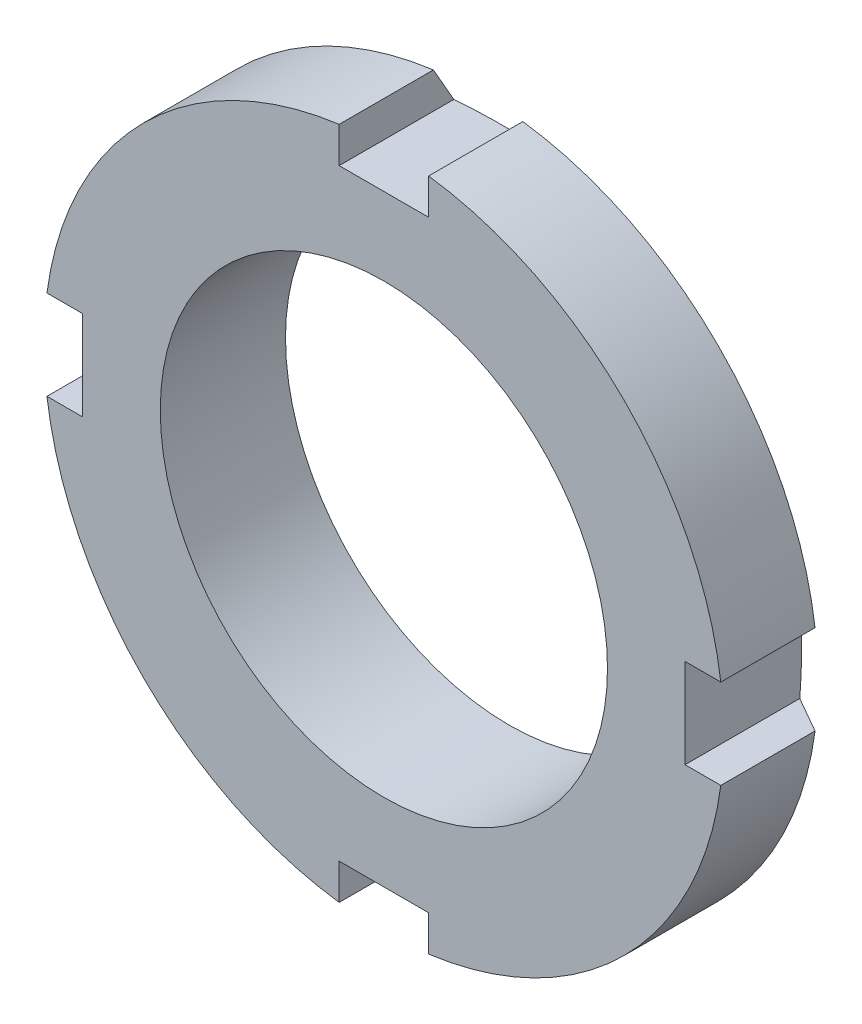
ISO-10303-21;
HEADER;
FILE_DESCRIPTION(('STEP AP214'),'2;1');
FILE_NAME('part.step','',(''),(''),'','','');
FILE_SCHEMA(('AUTOMOTIVE_DESIGN { 1 0 10303 214 1 1 1 1 }'));
ENDSEC;
DATA;
#1=APPLICATION_CONTEXT('core data for automotive mechanical design processes');
#2=APPLICATION_PROTOCOL_DEFINITION('international standard','automotive_design',2000,#1);
#3=PRODUCT_CONTEXT('',#1,'mechanical');
#4=PRODUCT('Part','Part','',(#3));
#5=PRODUCT_RELATED_PRODUCT_CATEGORY('part','',(#4));
#6=PRODUCT_DEFINITION_FORMATION('','',#4);
#7=PRODUCT_DEFINITION_CONTEXT('part definition',#1,'design');
#8=PRODUCT_DEFINITION('design','',#6,#7);
#9=PRODUCT_DEFINITION_SHAPE('','',#8);
#10=(LENGTH_UNIT() NAMED_UNIT(*) SI_UNIT(.MILLI.,.METRE.));
#11=(NAMED_UNIT(*) PLANE_ANGLE_UNIT() SI_UNIT($,.RADIAN.));
#12=(NAMED_UNIT(*) SI_UNIT($,.STERADIAN.) SOLID_ANGLE_UNIT());
#13=UNCERTAINTY_MEASURE_WITH_UNIT(LENGTH_MEASURE(1.E-05),#10,'distance_accuracy_value','');
#14=(GEOMETRIC_REPRESENTATION_CONTEXT(3) GLOBAL_UNCERTAINTY_ASSIGNED_CONTEXT((#13)) GLOBAL_UNIT_ASSIGNED_CONTEXT((#10,
#11,#12)) REPRESENTATION_CONTEXT('',''));
#15=CARTESIAN_POINT('',(0.,0.,0.));
#16=DIRECTION('',(0.,0.,1.));
#17=DIRECTION('',(1.,0.,0.));
#18=AXIS2_PLACEMENT_3D('',#15,#16,#17);
#19=CARTESIAN_POINT('',(0.,0.,0.));
#20=DIRECTION('',(0.,0.,-1.));
#21=DIRECTION('',(-1.,0.,0.));
#22=AXIS2_PLACEMENT_3D('',#19,#20,#21);
#23=CYLINDRICAL_SURFACE('',#22,19.);
#24=DIRECTION('',(0.,0.,-1.));
#25=VECTOR('',#24,1.);
#26=CARTESIAN_POINT('',(-2.5,18.8348082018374,6.9999999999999));
#27=LINE('',#26,#25);
#28=CARTESIAN_POINT('',(-2.5,18.8348082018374,6.9999999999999));
#29=VERTEX_POINT('',#28);
#30=CARTESIAN_POINT('',(-2.5,18.8348082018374,1.73205080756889));
#31=VERTEX_POINT('',#30);
#32=EDGE_CURVE('E148',#29,#31,#27,.T.);
#33=ORIENTED_EDGE('',*,*,#32,.T.);
#34=CARTESIAN_POINT('',(0.,0.,1.73205080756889));
#35=DIRECTION('',(0.,0.,-1.));
#36=DIRECTION('',(-1.,0.,0.));
#37=AXIS2_PLACEMENT_3D('',#34,#35,#36);
#38=CIRCLE('',#37,19.);
#39=CARTESIAN_POINT('',(-18.8348082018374,2.5,1.73205080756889));
#40=VERTEX_POINT('',#39);
#41=EDGE_CURVE('E12',#40,#31,#38,.T.);
#42=ORIENTED_EDGE('',*,*,#41,.F.);
#43=DIRECTION('',(0.,0.,-1.));
#44=VECTOR('',#43,1.);
#45=CARTESIAN_POINT('',(-18.8348082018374,2.5,6.9999999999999));
#46=LINE('',#45,#44);
#47=CARTESIAN_POINT('',(-18.8348082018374,2.5,6.9999999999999));
#48=VERTEX_POINT('',#47);
#49=EDGE_CURVE('E156',#48,#40,#46,.T.);
#50=ORIENTED_EDGE('',*,*,#49,.F.);
#51=CARTESIAN_POINT('',(0.,0.,6.9999999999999));
#52=DIRECTION('',(0.,0.,-1.));
#53=DIRECTION('',(-1.,0.,0.));
#54=AXIS2_PLACEMENT_3D('',#51,#52,#53);
#55=CIRCLE('',#54,19.);
#56=EDGE_CURVE('E164',#48,#29,#55,.T.);
#57=ORIENTED_EDGE('',*,*,#56,.T.);
#58=EDGE_LOOP('',(#33,#42,#50,#57));
#59=FACE_BOUND('',#58,.T.);
#60=ADVANCED_FACE('F33',(#59),#23,.T.);
#61=DIRECTION('',(0.,0.,-1.));
#62=VECTOR('',#61,1.);
#63=CARTESIAN_POINT('',(-18.8348082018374,-2.5,6.9999999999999));
#64=LINE('',#63,#62);
#65=CARTESIAN_POINT('',(-18.8348082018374,-2.5,6.9999999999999));
#66=VERTEX_POINT('',#65);
#67=CARTESIAN_POINT('',(-18.8348082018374,-2.5,1.73205080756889));
#68=VERTEX_POINT('',#67);
#69=EDGE_CURVE('E58',#66,#68,#64,.T.);
#70=ORIENTED_EDGE('',*,*,#69,.T.);
#71=CARTESIAN_POINT('',(-2.5,-18.8348082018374,1.73205080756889));
#72=VERTEX_POINT('',#71);
#73=EDGE_CURVE('E43',#72,#68,#38,.T.);
#74=ORIENTED_EDGE('',*,*,#73,.F.);
#75=DIRECTION('',(0.,0.,-1.));
#76=VECTOR('',#75,1.);
#77=CARTESIAN_POINT('',(-2.5,-18.8348082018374,6.9999999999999));
#78=LINE('',#77,#76);
#79=CARTESIAN_POINT('',(-2.5,-18.8348082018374,6.9999999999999));
#80=VERTEX_POINT('',#79);
#81=EDGE_CURVE('E289',#80,#72,#78,.T.);
#82=ORIENTED_EDGE('',*,*,#81,.F.);
#83=EDGE_CURVE('E172',#80,#66,#55,.T.);
#84=ORIENTED_EDGE('',*,*,#83,.T.);
#85=EDGE_LOOP('',(#70,#74,#82,#84));
#86=FACE_BOUND('',#85,.T.);
#87=ADVANCED_FACE('F232',(#86),#23,.T.);
#88=DIRECTION('',(0.,0.,-1.));
#89=VECTOR('',#88,1.);
#90=CARTESIAN_POINT('',(2.49999999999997,-18.8348082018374,6.9999999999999));
#91=LINE('',#90,#89);
#92=CARTESIAN_POINT('',(2.49999999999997,-18.8348082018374,6.9999999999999));
#93=VERTEX_POINT('',#92);
#94=CARTESIAN_POINT('',(2.49999999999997,-18.8348082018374,1.73205080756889));
#95=VERTEX_POINT('',#94);
#96=EDGE_CURVE('E240',#93,#95,#91,.T.);
#97=ORIENTED_EDGE('',*,*,#96,.T.);
#98=CARTESIAN_POINT('',(18.8348082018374,-2.5,1.73205080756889));
#99=VERTEX_POINT('',#98);
#100=EDGE_CURVE('E174',#99,#95,#38,.T.);
#101=ORIENTED_EDGE('',*,*,#100,.F.);
#102=DIRECTION('',(0.,0.,-1.));
#103=VECTOR('',#102,1.);
#104=CARTESIAN_POINT('',(18.8348082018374,-2.5,6.9999999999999));
#105=LINE('',#104,#103);
#106=CARTESIAN_POINT('',(18.8348082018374,-2.5,6.9999999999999));
#107=VERTEX_POINT('',#106);
#108=EDGE_CURVE('E248',#107,#99,#105,.T.);
#109=ORIENTED_EDGE('',*,*,#108,.F.);
#110=EDGE_CURVE('E176',#107,#93,#55,.T.);
#111=ORIENTED_EDGE('',*,*,#110,.T.);
#112=EDGE_LOOP('',(#97,#101,#109,#111));
#113=FACE_BOUND('',#112,.T.);
#114=ADVANCED_FACE('F225',(#113),#23,.T.);
#115=CARTESIAN_POINT('',(0.,0.,0.));
#116=DIRECTION('',(0.,0.,1.));
#117=DIRECTION('',(1.,0.,0.));
#118=AXIS2_PLACEMENT_3D('',#115,#116,#117);
#119=CONICAL_SURFACE('',#118,16.,1.0471975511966);
#120=CARTESIAN_POINT('',(-22.8090917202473,2.5,4.01009568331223));
#121=CARTESIAN_POINT('',(-22.1000019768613,2.5,3.60314984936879));
#122=CARTESIAN_POINT('',(-21.3908237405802,2.5,3.1963580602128));
#123=CARTESIAN_POINT('',(-19.972205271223,2.5,2.38323304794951));
#124=CARTESIAN_POINT('',(-19.2627650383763,2.5,1.976899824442));
#125=CARTESIAN_POINT('',(-17.8435359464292,2.5,1.16484149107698));
#126=CARTESIAN_POINT('',(-17.1337470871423,2.5,0.759116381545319));
#127=CARTESIAN_POINT('',(-15.7136478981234,2.5,-0.0514215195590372));
#128=CARTESIAN_POINT('',(-15.0033375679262,2.5,-0.456234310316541));
#129=CARTESIAN_POINT('',(-14.2926805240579,2.5,-0.860438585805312));
#130=B_SPLINE_CURVE_WITH_KNOTS('',3,(#120,#121,#122,#123,#124,#125,#126,#127,#128,#129),
.UNSPECIFIED.,.F.,.F.,(4,2,2,2,4),(0.,2.45269626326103,4.90539038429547,7.35808581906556,
9.81078344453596),.UNSPECIFIED.);
#131=CARTESIAN_POINT('',(-16.8348082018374,2.5,0.588564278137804));
#132=VERTEX_POINT('',#131);
#133=EDGE_CURVE('E198',#40,#132,#130,.T.);
#134=ORIENTED_EDGE('',*,*,#133,.F.);
#135=ORIENTED_EDGE('',*,*,#41,.T.);
#136=CARTESIAN_POINT('',(-2.5,12.7864938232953,-1.71553844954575));
#137=CARTESIAN_POINT('',(-2.5,13.1421491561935,-1.51401111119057));
#138=CARTESIAN_POINT('',(-2.5,13.4976764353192,-1.31225802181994));
#139=CARTESIAN_POINT('',(-2.5,14.2085191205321,-0.908379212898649));
#140=CARTESIAN_POINT('',(-2.5,14.5638345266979,-0.706253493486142));
#141=CARTESIAN_POINT('',(-2.5,15.629528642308,-0.0994360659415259));
#142=CARTESIAN_POINT('',(-2.5,16.3396562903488,0.305696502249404));
#143=CARTESIAN_POINT('',(-2.5,17.75946117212,1.11674810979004));
#144=CARTESIAN_POINT('',(-2.5,18.4691384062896,1.52266714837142));
#145=CARTESIAN_POINT('',(-2.5,19.8881652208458,2.33508001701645));
#146=CARTESIAN_POINT('',(-2.5,20.5975148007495,2.74157384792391));
#147=CARTESIAN_POINT('',(-2.5,21.3067605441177,3.14824844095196));
#148=B_SPLINE_CURVE_WITH_KNOTS('',3,(#136,#137,#138,#139,#140,#141,#142,#143,#144,#145,#146,
#147),.UNSPECIFIED.,.F.,.F.,(4,2,2,2,2,4),(0.,1.2263503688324,2.4527002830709,4.90539651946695,
7.35809036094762,9.81078780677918),.UNSPECIFIED.);
#149=CARTESIAN_POINT('',(-2.5,16.8348082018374,0.588564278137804));
#150=VERTEX_POINT('',#149);
#151=EDGE_CURVE('E151',#150,#31,#148,.T.);
#152=ORIENTED_EDGE('',*,*,#151,.F.);
#153=CARTESIAN_POINT('',(7.25390782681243,16.8348082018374,1.3458725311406));
#154=CARTESIAN_POINT('',(6.87593677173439,16.8348082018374,1.25950874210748));
#155=CARTESIAN_POINT('',(6.49669234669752,16.8348082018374,1.17856506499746));
#156=CARTESIAN_POINT('',(5.73577974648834,16.8348082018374,1.02855728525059));
#157=CARTESIAN_POINT('',(5.35411105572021,16.8348082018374,0.959495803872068));
#158=CARTESIAN_POINT('',(4.58824956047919,16.8348082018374,0.834266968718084));
#159=CARTESIAN_POINT('',(4.2040545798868,16.8348082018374,0.778112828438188));
#160=CARTESIAN_POINT('',(3.43390233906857,16.8348082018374,0.679745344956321));
#161=CARTESIAN_POINT('',(3.04794520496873,16.8348082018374,0.637531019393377));
#162=CARTESIAN_POINT('',(2.28257136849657,16.8348082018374,0.568532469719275));
#163=CARTESIAN_POINT('',(1.90318155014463,16.8348082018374,0.541451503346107));
#164=CARTESIAN_POINT('',(1.14363159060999,16.8348082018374,0.501930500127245));
#165=CARTESIAN_POINT('',(0.763471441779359,16.8348082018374,0.489490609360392));
#166=CARTESIAN_POINT('',(0.00321953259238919,16.8348082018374,0.479502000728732));
#167=CARTESIAN_POINT('',(-0.376872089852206,16.8348082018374,0.481942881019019));
#168=CARTESIAN_POINT('',(-1.13667046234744,16.8348082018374,0.501641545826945));
#169=CARTESIAN_POINT('',(-1.51637720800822,16.8348082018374,0.518899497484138));
#170=CARTESIAN_POINT('',(-2.32836711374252,16.8348082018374,0.5713573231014));
#171=CARTESIAN_POINT('',(-2.76050962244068,16.8348082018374,0.60874509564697));
#172=CARTESIAN_POINT('',(-3.6228610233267,16.8348082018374,0.701482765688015));
#173=CARTESIAN_POINT('',(-4.05306984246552,16.8348082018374,0.756833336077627));
#174=CARTESIAN_POINT('',(-4.91148622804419,16.8348082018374,0.884338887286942));
#175=CARTESIAN_POINT('',(-5.33969088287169,16.8348082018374,0.956513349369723));
#176=CARTESIAN_POINT('',(-6.19323505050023,16.8348082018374,1.1162012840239));
#177=CARTESIAN_POINT('',(-6.61857441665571,16.8348082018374,1.20371553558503));
#178=CARTESIAN_POINT('',(-7.47652281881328,16.8348082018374,1.39487270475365));
#179=CARTESIAN_POINT('',(-7.9090552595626,16.8348082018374,1.49885771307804));
#180=CARTESIAN_POINT('',(-8.7708313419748,16.8348082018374,1.71972453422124));
#181=CARTESIAN_POINT('',(-9.20007475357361,16.8348082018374,1.83660724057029));
#182=CARTESIAN_POINT('',(-10.0540714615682,16.8348082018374,2.08137667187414));
#183=CARTESIAN_POINT('',(-10.4788340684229,16.8348082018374,2.20923108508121));
#184=CARTESIAN_POINT('',(-11.3251434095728,16.8348082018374,2.47483851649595));
#185=CARTESIAN_POINT('',(-11.7466909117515,16.8348082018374,2.61258908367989));
#186=CARTESIAN_POINT('',(-12.166754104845,16.8348082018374,2.75462474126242));
#187=B_SPLINE_CURVE_WITH_KNOTS('',3,(#153,#154,#155,#156,#157,#158,#159,#160,#161,#162,#163,
#164,#165,#166,#167,#168,#169,#170,#171,#172,#173,#174,#175,#176,#177,#178,#179,#180,#181,#182,
#183,#184,#185,#186),.UNSPECIFIED.,.F.,.F.,(4,2,2,2,2,2,2,2,2,2,2,2,2,2,2,2,4),(0.,
1.16314767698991,2.32655162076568,3.49114131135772,4.65564891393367,5.79643996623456,
6.93724240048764,8.07724749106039,9.21726544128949,10.5181299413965,11.8190431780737,
13.1214703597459,14.4239637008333,15.758309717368,17.092748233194,18.4233834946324,
19.7536903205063),.UNSPECIFIED.);
#188=CARTESIAN_POINT('',(2.5,16.8348082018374,0.588564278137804));
#189=VERTEX_POINT('',#188);
#190=EDGE_CURVE('E155',#189,#150,#187,.T.);
#191=ORIENTED_EDGE('',*,*,#190,.F.);
#192=CARTESIAN_POINT('',(2.5,21.3067605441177,3.14824844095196));
#193=CARTESIAN_POINT('',(2.5,20.5975148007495,2.74157384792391));
#194=CARTESIAN_POINT('',(2.5,19.8881652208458,2.33508001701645));
#195=CARTESIAN_POINT('',(2.5,18.4691384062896,1.52266714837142));
#196=CARTESIAN_POINT('',(2.5,17.75946117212,1.11674810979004));
#197=CARTESIAN_POINT('',(2.5,16.3396562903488,0.305696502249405));
#198=CARTESIAN_POINT('',(2.5,15.629528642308,-0.0994360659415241));
#199=CARTESIAN_POINT('',(2.5,14.5638345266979,-0.706253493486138));
#200=CARTESIAN_POINT('',(2.5,14.2085191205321,-0.908379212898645));
#201=CARTESIAN_POINT('',(2.5,13.4976764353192,-1.31225802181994));
#202=CARTESIAN_POINT('',(2.5,13.1421491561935,-1.51401111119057));
#203=CARTESIAN_POINT('',(2.5,12.7864938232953,-1.71553844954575));
#204=B_SPLINE_CURVE_WITH_KNOTS('',3,(#192,#193,#194,#195,#196,#197,#198,#199,#200,#201,#202,
#203),.UNSPECIFIED.,.F.,.F.,(4,2,2,2,2,4),(0.,2.45269744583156,4.90539128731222,
7.35808752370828,8.58443743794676,9.81078780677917),.UNSPECIFIED.);
#205=CARTESIAN_POINT('',(2.5,18.8348082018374,1.73205080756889));
#206=VERTEX_POINT('',#205);
#207=EDGE_CURVE('E264',#206,#189,#204,.T.);
#208=ORIENTED_EDGE('',*,*,#207,.F.);
#209=CARTESIAN_POINT('',(18.8348082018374,2.5,1.73205080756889));
#210=VERTEX_POINT('',#209);
#211=EDGE_CURVE('E42',#206,#210,#38,.T.);
#212=ORIENTED_EDGE('',*,*,#211,.T.);
#213=CARTESIAN_POINT('',(12.7864938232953,2.5,-1.71553844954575));
#214=CARTESIAN_POINT('',(13.1421491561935,2.5,-1.51401111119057));
#215=CARTESIAN_POINT('',(13.4976764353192,2.5,-1.31225802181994));
#216=CARTESIAN_POINT('',(14.2085191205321,2.5,-0.908379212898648));
#217=CARTESIAN_POINT('',(14.5638345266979,2.5,-0.706253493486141));
#218=CARTESIAN_POINT('',(15.629528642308,2.5,-0.0994360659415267));
#219=CARTESIAN_POINT('',(16.3396562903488,2.5,0.305696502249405));
#220=CARTESIAN_POINT('',(17.75946117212,2.5,1.11674810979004));
#221=CARTESIAN_POINT('',(18.4691384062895,2.5,1.52266714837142));
#222=CARTESIAN_POINT('',(19.8881652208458,2.5,2.33508001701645));
#223=CARTESIAN_POINT('',(20.5975148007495,2.5,2.74157384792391));
#224=CARTESIAN_POINT('',(21.3067605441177,2.5,3.14824844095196));
#225=B_SPLINE_CURVE_WITH_KNOTS('',3,(#213,#214,#215,#216,#217,#218,#219,#220,#221,#222,#223,
#224),.UNSPECIFIED.,.F.,.F.,(4,2,2,2,2,4),(0.,1.2263503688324,2.45270028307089,4.90539651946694,
7.3580903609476,9.81078780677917),.UNSPECIFIED.);
#226=CARTESIAN_POINT('',(16.8348082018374,2.5,0.588564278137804));
#227=VERTEX_POINT('',#226);
#228=EDGE_CURVE('E262',#227,#210,#225,.T.);
#229=ORIENTED_EDGE('',*,*,#228,.F.);
#230=CARTESIAN_POINT('',(16.8348082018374,-12.166754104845,2.75462474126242));
#231=CARTESIAN_POINT('',(16.8348082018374,-11.7466909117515,2.61258908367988));
#232=CARTESIAN_POINT('',(16.8348082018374,-11.3251434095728,2.47483851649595));
#233=CARTESIAN_POINT('',(16.8348082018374,-10.4788340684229,2.2092310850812));
#234=CARTESIAN_POINT('',(16.8348082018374,-10.0540714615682,2.08137667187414));
#235=CARTESIAN_POINT('',(16.8348082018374,-9.20007475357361,1.83660724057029));
#236=CARTESIAN_POINT('',(16.8348082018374,-8.7708313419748,1.71972453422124));
#237=CARTESIAN_POINT('',(16.8348082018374,-7.9090552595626,1.49885771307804));
#238=CARTESIAN_POINT('',(16.8348082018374,-7.47652281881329,1.39487270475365));
#239=CARTESIAN_POINT('',(16.8348082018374,-6.61857441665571,1.20371553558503));
#240=CARTESIAN_POINT('',(16.8348082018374,-6.19323505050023,1.11620128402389));
#241=CARTESIAN_POINT('',(16.8348082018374,-5.33969088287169,0.956513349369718));
#242=CARTESIAN_POINT('',(16.8348082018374,-4.91148622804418,0.884338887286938));
#243=CARTESIAN_POINT('',(16.8348082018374,-4.05306984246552,0.756833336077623));
#244=CARTESIAN_POINT('',(16.8348082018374,-3.6228610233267,0.70148276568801));
#245=CARTESIAN_POINT('',(16.8348082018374,-2.76050962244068,0.608745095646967));
#246=CARTESIAN_POINT('',(16.8348082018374,-2.32836711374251,0.571357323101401));
#247=CARTESIAN_POINT('',(16.8348082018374,-1.51637720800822,0.518899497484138));
#248=CARTESIAN_POINT('',(16.8348082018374,-1.13667046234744,0.501641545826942));
#249=CARTESIAN_POINT('',(16.8348082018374,-0.376872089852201,0.481942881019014));
#250=CARTESIAN_POINT('',(16.8348082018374,0.00321953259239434,0.479502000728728));
#251=CARTESIAN_POINT('',(16.8348082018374,0.763471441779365,0.489490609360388));
#252=CARTESIAN_POINT('',(16.8348082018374,1.14363159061,0.501930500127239));
#253=CARTESIAN_POINT('',(16.8348082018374,1.90318155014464,0.541451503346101));
#254=CARTESIAN_POINT('',(16.8348082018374,2.28257136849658,0.568532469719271));
#255=CARTESIAN_POINT('',(16.8348082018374,3.04794520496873,0.637531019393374));
#256=CARTESIAN_POINT('',(16.8348082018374,3.43390233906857,0.679745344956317));
#257=CARTESIAN_POINT('',(16.8348082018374,4.2040545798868,0.778112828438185));
#258=CARTESIAN_POINT('',(16.8348082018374,4.58824956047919,0.834266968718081));
#259=CARTESIAN_POINT('',(16.8348082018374,5.35411105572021,0.959495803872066));
#260=CARTESIAN_POINT('',(16.8348082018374,5.73577974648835,1.02855728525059));
#261=CARTESIAN_POINT('',(16.8348082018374,6.49669234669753,1.17856506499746));
#262=CARTESIAN_POINT('',(16.8348082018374,6.8759367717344,1.25950874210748));
#263=CARTESIAN_POINT('',(16.8348082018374,7.25390782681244,1.3458725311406));
#264=B_SPLINE_CURVE_WITH_KNOTS('',3,(#230,#231,#232,#233,#234,#235,#236,#237,#238,#239,#240,
#241,#242,#243,#244,#245,#246,#247,#248,#249,#250,#251,#252,#253,#254,#255,#256,#257,#258,#259,
#260,#261,#262,#263),.UNSPECIFIED.,.F.,.F.,(4,2,2,2,2,2,2,2,2,2,2,2,2,2,2,2,4),(0.,
1.33030682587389,2.6609420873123,3.99538060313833,5.32972661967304,6.63221996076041,
7.93464714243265,9.2355603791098,10.5364248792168,11.6764428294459,12.8164479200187,
13.9572503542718,15.0980414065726,16.2625490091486,17.4271386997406,18.5905426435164,
19.7536903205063),.UNSPECIFIED.);
#265=CARTESIAN_POINT('',(16.8348082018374,-2.5,0.588564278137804));
#266=VERTEX_POINT('',#265);
#267=EDGE_CURVE('E326',#266,#227,#264,.T.);
#268=ORIENTED_EDGE('',*,*,#267,.F.);
#269=CARTESIAN_POINT('',(21.3067605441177,-2.5,3.14824844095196));
#270=CARTESIAN_POINT('',(20.5975148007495,-2.5,2.74157384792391));
#271=CARTESIAN_POINT('',(19.8881652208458,-2.5,2.33508001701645));
#272=CARTESIAN_POINT('',(18.4691384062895,-2.5,1.52266714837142));
#273=CARTESIAN_POINT('',(17.75946117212,-2.5,1.11674810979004));
#274=CARTESIAN_POINT('',(16.3396562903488,-2.5,0.305696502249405));
#275=CARTESIAN_POINT('',(15.629528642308,-2.5,-0.0994360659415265));
#276=CARTESIAN_POINT('',(14.5638345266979,-2.5,-0.706253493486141));
#277=CARTESIAN_POINT('',(14.2085191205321,-2.5,-0.908379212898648));
#278=CARTESIAN_POINT('',(13.4976764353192,-2.5,-1.31225802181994));
#279=CARTESIAN_POINT('',(13.1421491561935,-2.5,-1.51401111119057));
#280=CARTESIAN_POINT('',(12.7864938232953,-2.5,-1.71553844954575));
#281=B_SPLINE_CURVE_WITH_KNOTS('',3,(#269,#270,#271,#272,#273,#274,#275,#276,#277,#278,#279,
#280),.UNSPECIFIED.,.F.,.F.,(4,2,2,2,2,4),(0.,2.45269744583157,4.90539128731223,
7.35808752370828,8.58443743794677,9.81078780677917),.UNSPECIFIED.);
#282=EDGE_CURVE('E257',#99,#266,#281,.T.);
#283=ORIENTED_EDGE('',*,*,#282,.F.);
#284=ORIENTED_EDGE('',*,*,#100,.T.);
#285=CARTESIAN_POINT('',(2.5,-14.2926805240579,-0.860438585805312));
#286=CARTESIAN_POINT('',(2.5,-15.0033375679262,-0.456234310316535));
#287=CARTESIAN_POINT('',(2.5,-15.7136478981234,-0.0514215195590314));
#288=CARTESIAN_POINT('',(2.5,-17.1337470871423,0.759116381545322));
#289=CARTESIAN_POINT('',(2.5,-17.8435359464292,1.16484149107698));
#290=CARTESIAN_POINT('',(2.5,-19.2627650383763,1.976899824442));
#291=CARTESIAN_POINT('',(2.5,-19.972205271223,2.38323304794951));
#292=CARTESIAN_POINT('',(2.5,-21.3908237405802,3.19635806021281));
#293=CARTESIAN_POINT('',(2.5,-22.1000019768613,3.6031498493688));
#294=CARTESIAN_POINT('',(2.5,-22.8090917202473,4.01009568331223));
#295=B_SPLINE_CURVE_WITH_KNOTS('',3,(#285,#286,#287,#288,#289,#290,#291,#292,#293,#294),
.UNSPECIFIED.,.F.,.F.,(4,2,2,2,4),(0.,2.4526976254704,4.90539306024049,7.35808718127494,
9.81078344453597),.UNSPECIFIED.);
#296=CARTESIAN_POINT('',(2.5,-16.8348082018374,0.588564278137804));
#297=VERTEX_POINT('',#296);
#298=EDGE_CURVE('E255',#297,#95,#295,.T.);
#299=ORIENTED_EDGE('',*,*,#298,.F.);
#300=CARTESIAN_POINT('',(-12.166754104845,-16.8348082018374,2.75462474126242));
#301=CARTESIAN_POINT('',(-11.7466909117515,-16.8348082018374,2.61258908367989));
#302=CARTESIAN_POINT('',(-11.3251434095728,-16.8348082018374,2.47483851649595));
#303=CARTESIAN_POINT('',(-10.4788340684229,-16.8348082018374,2.2092310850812));
#304=CARTESIAN_POINT('',(-10.0540714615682,-16.8348082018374,2.08137667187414));
#305=CARTESIAN_POINT('',(-9.20007475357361,-16.8348082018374,1.83660724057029));
#306=CARTESIAN_POINT('',(-8.7708313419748,-16.8348082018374,1.71972453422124));
#307=CARTESIAN_POINT('',(-7.9090552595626,-16.8348082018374,1.49885771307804));
#308=CARTESIAN_POINT('',(-7.47652281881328,-16.8348082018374,1.39487270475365));
#309=CARTESIAN_POINT('',(-6.61857441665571,-16.8348082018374,1.20371553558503));
#310=CARTESIAN_POINT('',(-6.19323505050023,-16.8348082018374,1.1162012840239));
#311=CARTESIAN_POINT('',(-5.33969088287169,-16.8348082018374,0.956513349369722));
#312=CARTESIAN_POINT('',(-4.91148622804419,-16.8348082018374,0.884338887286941));
#313=CARTESIAN_POINT('',(-4.05306984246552,-16.8348082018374,0.756833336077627));
#314=CARTESIAN_POINT('',(-3.6228610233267,-16.8348082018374,0.701482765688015));
#315=CARTESIAN_POINT('',(-2.76050962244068,-16.8348082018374,0.60874509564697));
#316=CARTESIAN_POINT('',(-2.32836711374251,-16.8348082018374,0.5713573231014));
#317=CARTESIAN_POINT('',(-1.51637720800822,-16.8348082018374,0.518899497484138));
#318=CARTESIAN_POINT('',(-1.13667046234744,-16.8348082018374,0.501641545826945));
#319=CARTESIAN_POINT('',(-0.376872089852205,-16.8348082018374,0.481942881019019));
#320=CARTESIAN_POINT('',(0.00321953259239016,-16.8348082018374,0.479502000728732));
#321=CARTESIAN_POINT('',(0.763471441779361,-16.8348082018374,0.489490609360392));
#322=CARTESIAN_POINT('',(1.14363159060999,-16.8348082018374,0.501930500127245));
#323=CARTESIAN_POINT('',(1.90318155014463,-16.8348082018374,0.541451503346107));
#324=CARTESIAN_POINT('',(2.28257136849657,-16.8348082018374,0.568532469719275));
#325=CARTESIAN_POINT('',(3.04794520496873,-16.8348082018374,0.637531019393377));
#326=CARTESIAN_POINT('',(3.43390233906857,-16.8348082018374,0.679745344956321));
#327=CARTESIAN_POINT('',(4.2040545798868,-16.8348082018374,0.778112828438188));
#328=CARTESIAN_POINT('',(4.58824956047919,-16.8348082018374,0.834266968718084));
#329=CARTESIAN_POINT('',(5.35411105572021,-16.8348082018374,0.959495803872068));
#330=CARTESIAN_POINT('',(5.73577974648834,-16.8348082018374,1.02855728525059));
#331=CARTESIAN_POINT('',(6.49669234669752,-16.8348082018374,1.17856506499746));
#332=CARTESIAN_POINT('',(6.87593677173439,-16.8348082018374,1.25950874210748));
#333=CARTESIAN_POINT('',(7.25390782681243,-16.8348082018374,1.3458725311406));
#334=B_SPLINE_CURVE_WITH_KNOTS('',3,(#300,#301,#302,#303,#304,#305,#306,#307,#308,#309,#310,
#311,#312,#313,#314,#315,#316,#317,#318,#319,#320,#321,#322,#323,#324,#325,#326,#327,#328,#329,
#330,#331,#332,#333),.UNSPECIFIED.,.F.,.F.,(4,2,2,2,2,2,2,2,2,2,2,2,2,2,2,2,4),(0.,
1.33030682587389,2.6609420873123,3.99538060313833,5.32972661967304,6.6322199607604,
7.93464714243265,9.23556037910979,10.5364248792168,11.6764428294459,12.8164479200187,
13.9572503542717,15.0980414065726,16.2625490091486,17.4271386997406,18.5905426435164,
19.7536903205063),.UNSPECIFIED.);
#335=CARTESIAN_POINT('',(-2.5,-16.8348082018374,0.588564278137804));
#336=VERTEX_POINT('',#335);
#337=EDGE_CURVE('E356',#336,#297,#334,.T.);
#338=ORIENTED_EDGE('',*,*,#337,.F.);
#339=CARTESIAN_POINT('',(-2.5,-22.8090917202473,4.01009568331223));
#340=CARTESIAN_POINT('',(-2.5,-22.1000019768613,3.6031498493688));
#341=CARTESIAN_POINT('',(-2.5,-21.3908237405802,3.1963580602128));
#342=CARTESIAN_POINT('',(-2.5,-19.972205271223,2.38323304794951));
#343=CARTESIAN_POINT('',(-2.5,-19.2627650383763,1.976899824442));
#344=CARTESIAN_POINT('',(-2.5,-17.8435359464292,1.16484149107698));
#345=CARTESIAN_POINT('',(-2.5,-17.1337470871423,0.759116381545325));
#346=CARTESIAN_POINT('',(-2.5,-15.7136478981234,-0.0514215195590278));
#347=CARTESIAN_POINT('',(-2.5,-15.0033375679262,-0.456234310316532));
#348=CARTESIAN_POINT('',(-2.5,-14.2926805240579,-0.860438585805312));
#349=B_SPLINE_CURVE_WITH_KNOTS('',3,(#339,#340,#341,#342,#343,#344,#345,#346,#347,#348),
.UNSPECIFIED.,.F.,.F.,(4,2,2,2,4),(0.,2.45269626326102,4.90539038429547,7.35808581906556,
9.81078344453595),.UNSPECIFIED.);
#350=EDGE_CURVE('E361',#72,#336,#349,.T.);
#351=ORIENTED_EDGE('',*,*,#350,.F.);
#352=ORIENTED_EDGE('',*,*,#73,.T.);
#353=CARTESIAN_POINT('',(-14.2926805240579,-2.5,-0.860438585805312));
#354=CARTESIAN_POINT('',(-15.0033375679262,-2.5,-0.456234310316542));
#355=CARTESIAN_POINT('',(-15.7136478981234,-2.5,-0.0514215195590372));
#356=CARTESIAN_POINT('',(-17.1337470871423,-2.5,0.75911638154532));
#357=CARTESIAN_POINT('',(-17.8435359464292,-2.5,1.16484149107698));
#358=CARTESIAN_POINT('',(-19.2627650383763,-2.5,1.976899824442));
#359=CARTESIAN_POINT('',(-19.972205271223,-2.5,2.38323304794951));
#360=CARTESIAN_POINT('',(-21.3908237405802,-2.5,3.1963580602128));
#361=CARTESIAN_POINT('',(-22.1000019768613,-2.5,3.60314984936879));
#362=CARTESIAN_POINT('',(-22.8090917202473,-2.5,4.01009568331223));
#363=B_SPLINE_CURVE_WITH_KNOTS('',3,(#353,#354,#355,#356,#357,#358,#359,#360,#361,#362),
.UNSPECIFIED.,.F.,.F.,(4,2,2,2,4),(0.,2.45269762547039,4.90539306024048,7.35808718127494,
9.81078344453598),.UNSPECIFIED.);
#364=CARTESIAN_POINT('',(-16.8348082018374,-2.5,0.588564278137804));
#365=VERTEX_POINT('',#364);
#366=EDGE_CURVE('E366',#365,#68,#363,.T.);
#367=ORIENTED_EDGE('',*,*,#366,.F.);
#368=CARTESIAN_POINT('',(-16.8348082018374,7.25390782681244,1.3458725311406));
#369=CARTESIAN_POINT('',(-16.8348082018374,6.8759367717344,1.25950874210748));
#370=CARTESIAN_POINT('',(-16.8348082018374,6.49669234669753,1.17856506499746));
#371=CARTESIAN_POINT('',(-16.8348082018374,5.73577974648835,1.02855728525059));
#372=CARTESIAN_POINT('',(-16.8348082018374,5.35411105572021,0.959495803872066));
#373=CARTESIAN_POINT('',(-16.8348082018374,4.58824956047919,0.834266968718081));
#374=CARTESIAN_POINT('',(-16.8348082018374,4.2040545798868,0.778112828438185));
#375=CARTESIAN_POINT('',(-16.8348082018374,3.43390233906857,0.679745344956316));
#376=CARTESIAN_POINT('',(-16.8348082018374,3.04794520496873,0.637531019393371));
#377=CARTESIAN_POINT('',(-16.8348082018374,2.28257136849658,0.568532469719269));
#378=CARTESIAN_POINT('',(-16.8348082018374,1.90318155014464,0.541451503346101));
#379=CARTESIAN_POINT('',(-16.8348082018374,1.14363159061,0.50193050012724));
#380=CARTESIAN_POINT('',(-16.8348082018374,0.763471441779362,0.489490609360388));
#381=CARTESIAN_POINT('',(-16.8348082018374,0.00321953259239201,0.479502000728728));
#382=CARTESIAN_POINT('',(-16.8348082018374,-0.376872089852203,0.481942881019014));
#383=CARTESIAN_POINT('',(-16.8348082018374,-1.13667046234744,0.501641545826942));
#384=CARTESIAN_POINT('',(-16.8348082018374,-1.51637720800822,0.518899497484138));
#385=CARTESIAN_POINT('',(-16.8348082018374,-2.32836711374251,0.571357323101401));
#386=CARTESIAN_POINT('',(-16.8348082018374,-2.76050962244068,0.608745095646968));
#387=CARTESIAN_POINT('',(-16.8348082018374,-3.6228610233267,0.70148276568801));
#388=CARTESIAN_POINT('',(-16.8348082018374,-4.05306984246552,0.756833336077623));
#389=CARTESIAN_POINT('',(-16.8348082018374,-4.91148622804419,0.884338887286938));
#390=CARTESIAN_POINT('',(-16.8348082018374,-5.33969088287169,0.95651334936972));
#391=CARTESIAN_POINT('',(-16.8348082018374,-6.19323505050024,1.1162012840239));
#392=CARTESIAN_POINT('',(-16.8348082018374,-6.61857441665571,1.20371553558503));
#393=CARTESIAN_POINT('',(-16.8348082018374,-7.47652281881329,1.39487270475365));
#394=CARTESIAN_POINT('',(-16.8348082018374,-7.9090552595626,1.49885771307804));
#395=CARTESIAN_POINT('',(-16.8348082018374,-8.7708313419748,1.71972453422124));
#396=CARTESIAN_POINT('',(-16.8348082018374,-9.20007475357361,1.83660724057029));
#397=CARTESIAN_POINT('',(-16.8348082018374,-10.0540714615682,2.08137667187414));
#398=CARTESIAN_POINT('',(-16.8348082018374,-10.4788340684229,2.2092310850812));
#399=CARTESIAN_POINT('',(-16.8348082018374,-11.3251434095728,2.47483851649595));
#400=CARTESIAN_POINT('',(-16.8348082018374,-11.7466909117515,2.61258908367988));
#401=CARTESIAN_POINT('',(-16.8348082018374,-12.166754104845,2.75462474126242));
#402=B_SPLINE_CURVE_WITH_KNOTS('',3,(#368,#369,#370,#371,#372,#373,#374,#375,#376,#377,#378,
#379,#380,#381,#382,#383,#384,#385,#386,#387,#388,#389,#390,#391,#392,#393,#394,#395,#396,#397,
#398,#399,#400,#401),.UNSPECIFIED.,.F.,.F.,(4,2,2,2,2,2,2,2,2,2,2,2,2,2,2,2,4),(0.,
1.16314767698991,2.32655162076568,3.49114131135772,4.65564891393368,5.79643996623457,
6.93724240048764,8.07724749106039,9.21726544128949,10.5181299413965,11.8190431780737,
13.1214703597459,14.4239637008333,15.758309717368,17.092748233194,18.4233834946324,
19.7536903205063),.UNSPECIFIED.);
#403=EDGE_CURVE('E370',#132,#365,#402,.T.);
#404=ORIENTED_EDGE('',*,*,#403,.F.);
#405=EDGE_LOOP('',(#134,#135,#152,#191,#208,#212,#229,#268,#283,#284,#299,#338,#351,#352,#367,#404));
#406=FACE_BOUND('',#405,.T.);
#407=CARTESIAN_POINT('',(0.,0.,0.));
#408=DIRECTION('',(0.,0.,-1.));
#409=DIRECTION('',(-1.,0.,0.));
#410=AXIS2_PLACEMENT_3D('',#407,#408,#409);
#411=CIRCLE('',#410,16.);
#412=CARTESIAN_POINT('',(-16.,0.,0.));
#413=VERTEX_POINT('',#412);
#414=EDGE_CURVE('E188',#413,#413,#411,.T.);
#415=ORIENTED_EDGE('',*,*,#414,.F.);
#416=EDGE_LOOP('',(#415));
#417=FACE_BOUND('',#416,.T.);
#418=ADVANCED_FACE('F35',(#406,#417),#119,.T.);
#419=DIRECTION('',(0.,0.,-1.));
#420=VECTOR('',#419,1.);
#421=CARTESIAN_POINT('',(18.8348082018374,2.5,6.9999999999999));
#422=LINE('',#421,#420);
#423=CARTESIAN_POINT('',(18.8348082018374,2.5,6.9999999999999));
#424=VERTEX_POINT('',#423);
#425=EDGE_CURVE('E268',#424,#210,#422,.T.);
#426=ORIENTED_EDGE('',*,*,#425,.T.);
#427=ORIENTED_EDGE('',*,*,#211,.F.);
#428=DIRECTION('',(0.,0.,-1.));
#429=VECTOR('',#428,1.);
#430=CARTESIAN_POINT('',(2.5,18.8348082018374,6.9999999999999));
#431=LINE('',#430,#429);
#432=CARTESIAN_POINT('',(2.5,18.8348082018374,6.9999999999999));
#433=VERTEX_POINT('',#432);
#434=EDGE_CURVE('E266',#433,#206,#431,.T.);
#435=ORIENTED_EDGE('',*,*,#434,.F.);
#436=EDGE_CURVE('E171',#433,#424,#55,.T.);
#437=ORIENTED_EDGE('',*,*,#436,.T.);
#438=EDGE_LOOP('',(#426,#427,#435,#437));
#439=FACE_BOUND('',#438,.T.);
#440=ADVANCED_FACE('F222',(#439),#23,.T.);
#441=CARTESIAN_POINT('',(0.,19.,6.9999999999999));
#442=DIRECTION('',(0.,0.,1.));
#443=DIRECTION('',(1.,0.,0.));
#444=AXIS2_PLACEMENT_3D('',#441,#442,#443);
#445=PLANE('',#444);
#446=DIRECTION('',(1.,0.,0.));
#447=VECTOR('',#446,1.);
#448=CARTESIAN_POINT('',(-16.8348082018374,2.5,6.9999999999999));
#449=LINE('',#448,#447);
#450=CARTESIAN_POINT('',(-16.8348082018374,2.5,6.9999999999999));
#451=VERTEX_POINT('',#450);
#452=EDGE_CURVE('E168',#48,#451,#449,.T.);
#453=ORIENTED_EDGE('',*,*,#452,.T.);
#454=DIRECTION('',(0.,-1.,0.));
#455=VECTOR('',#454,1.);
#456=CARTESIAN_POINT('',(-16.8348082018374,2.5,6.9999999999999));
#457=LINE('',#456,#455);
#458=CARTESIAN_POINT('',(-16.8348082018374,-2.5,6.9999999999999));
#459=VERTEX_POINT('',#458);
#460=EDGE_CURVE('E396',#451,#459,#457,.T.);
#461=ORIENTED_EDGE('',*,*,#460,.T.);
#462=DIRECTION('',(-1.,0.,0.));
#463=VECTOR('',#462,1.);
#464=CARTESIAN_POINT('',(-16.8348082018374,-2.5,6.9999999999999));
#465=LINE('',#464,#463);
#466=EDGE_CURVE('E388',#459,#66,#465,.T.);
#467=ORIENTED_EDGE('',*,*,#466,.T.);
#468=ORIENTED_EDGE('',*,*,#83,.F.);
#469=DIRECTION('',(0.,1.,0.));
#470=VECTOR('',#469,1.);
#471=CARTESIAN_POINT('',(-2.5,-16.8348082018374,6.9999999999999));
#472=LINE('',#471,#470);
#473=CARTESIAN_POINT('',(-2.5,-16.8348082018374,6.9999999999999));
#474=VERTEX_POINT('',#473);
#475=EDGE_CURVE('E395',#80,#474,#472,.T.);
#476=ORIENTED_EDGE('',*,*,#475,.T.);
#477=DIRECTION('',(1.,0.,0.));
#478=VECTOR('',#477,1.);
#479=CARTESIAN_POINT('',(-2.5,-16.8348082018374,6.9999999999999));
#480=LINE('',#479,#478);
#481=CARTESIAN_POINT('',(2.5,-16.8348082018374,6.9999999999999));
#482=VERTEX_POINT('',#481);
#483=EDGE_CURVE('E398',#474,#482,#480,.T.);
#484=ORIENTED_EDGE('',*,*,#483,.T.);
#485=DIRECTION('',(0.,-1.,0.));
#486=VECTOR('',#485,1.);
#487=CARTESIAN_POINT('',(2.5,-16.8348082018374,6.9999999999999));
#488=LINE('',#487,#486);
#489=EDGE_CURVE('E404',#482,#93,#488,.T.);
#490=ORIENTED_EDGE('',*,*,#489,.T.);
#491=ORIENTED_EDGE('',*,*,#110,.F.);
#492=DIRECTION('',(-1.,0.,0.));
#493=VECTOR('',#492,1.);
#494=CARTESIAN_POINT('',(16.8348082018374,-2.5,6.9999999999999));
#495=LINE('',#494,#493);
#496=CARTESIAN_POINT('',(16.8348082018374,-2.5,6.9999999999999));
#497=VERTEX_POINT('',#496);
#498=EDGE_CURVE('E406',#107,#497,#495,.T.);
#499=ORIENTED_EDGE('',*,*,#498,.T.);
#500=DIRECTION('',(0.,1.,0.));
#501=VECTOR('',#500,1.);
#502=CARTESIAN_POINT('',(16.8348082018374,2.5,6.9999999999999));
#503=LINE('',#502,#501);
#504=CARTESIAN_POINT('',(16.8348082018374,2.5,6.9999999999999));
#505=VERTEX_POINT('',#504);
#506=EDGE_CURVE('E409',#497,#505,#503,.T.);
#507=ORIENTED_EDGE('',*,*,#506,.T.);
#508=DIRECTION('',(1.,0.,0.));
#509=VECTOR('',#508,1.);
#510=CARTESIAN_POINT('',(16.8348082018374,2.5,6.9999999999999));
#511=LINE('',#510,#509);
#512=EDGE_CURVE('E412',#505,#424,#511,.T.);
#513=ORIENTED_EDGE('',*,*,#512,.T.);
#514=ORIENTED_EDGE('',*,*,#436,.F.);
#515=DIRECTION('',(0.,-1.,0.));
#516=VECTOR('',#515,1.);
#517=CARTESIAN_POINT('',(2.5,16.8348082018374,6.9999999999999));
#518=LINE('',#517,#516);
#519=CARTESIAN_POINT('',(2.5,16.8348082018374,6.9999999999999));
#520=VERTEX_POINT('',#519);
#521=EDGE_CURVE('E414',#433,#520,#518,.T.);
#522=ORIENTED_EDGE('',*,*,#521,.T.);
#523=DIRECTION('',(-1.,0.,0.));
#524=VECTOR('',#523,1.);
#525=CARTESIAN_POINT('',(-2.5,16.8348082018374,6.9999999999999));
#526=LINE('',#525,#524);
#527=CARTESIAN_POINT('',(-2.5,16.8348082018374,6.9999999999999));
#528=VERTEX_POINT('',#527);
#529=EDGE_CURVE('E167',#520,#528,#526,.T.);
#530=ORIENTED_EDGE('',*,*,#529,.T.);
#531=DIRECTION('',(0.,1.,0.));
#532=VECTOR('',#531,1.);
#533=CARTESIAN_POINT('',(-2.5,16.8348082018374,6.9999999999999));
#534=LINE('',#533,#532);
#535=EDGE_CURVE('E50',#528,#29,#534,.T.);
#536=ORIENTED_EDGE('',*,*,#535,.T.);
#537=ORIENTED_EDGE('',*,*,#56,.F.);
#538=EDGE_LOOP('',(#453,#461,#467,#468,#476,#484,#490,#491,#499,#507,#513,#514,#522,#530,#536,#537));
#539=FACE_BOUND('',#538,.T.);
#540=CARTESIAN_POINT('',(0.,0.,6.9999999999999));
#541=DIRECTION('',(0.,0.,-1.));
#542=DIRECTION('',(-1.,0.,0.));
#543=AXIS2_PLACEMENT_3D('',#540,#541,#542);
#544=CIRCLE('',#543,12.5);
#545=CARTESIAN_POINT('',(-12.5,0.,6.9999999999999));
#546=VERTEX_POINT('',#545);
#547=EDGE_CURVE('E179',#546,#546,#544,.T.);
#548=ORIENTED_EDGE('',*,*,#547,.T.);
#549=EDGE_LOOP('',(#548));
#550=FACE_BOUND('',#549,.T.);
#551=ADVANCED_FACE('F162',(#539,#550),#445,.T.);
#552=CARTESIAN_POINT('',(0.,0.,0.));
#553=DIRECTION('',(0.,0.,-1.));
#554=DIRECTION('',(-1.,0.,0.));
#555=AXIS2_PLACEMENT_3D('',#552,#553,#554);
#556=CYLINDRICAL_SURFACE('',#555,12.5);
#557=CARTESIAN_POINT('',(0.,0.,0.));
#558=DIRECTION('',(0.,0.,-1.));
#559=DIRECTION('',(-1.,0.,0.));
#560=AXIS2_PLACEMENT_3D('',#557,#558,#559);
#561=CIRCLE('',#560,12.5);
#562=CARTESIAN_POINT('',(-12.5,0.,0.));
#563=VERTEX_POINT('',#562);
#564=EDGE_CURVE('E185',#563,#563,#561,.T.);
#565=ORIENTED_EDGE('',*,*,#564,.T.);
#566=EDGE_LOOP('',(#565));
#567=FACE_BOUND('',#566,.T.);
#568=ORIENTED_EDGE('',*,*,#547,.F.);
#569=EDGE_LOOP('',(#568));
#570=FACE_BOUND('',#569,.T.);
#571=ADVANCED_FACE('F216',(#567,#570),#556,.F.);
#572=CARTESIAN_POINT('',(0.,12.5,0.));
#573=DIRECTION('',(0.,0.,-1.));
#574=DIRECTION('',(-1.,0.,0.));
#575=AXIS2_PLACEMENT_3D('',#572,#573,#574);
#576=PLANE('',#575);
#577=ORIENTED_EDGE('',*,*,#414,.T.);
#578=EDGE_LOOP('',(#577));
#579=FACE_BOUND('',#578,.T.);
#580=ORIENTED_EDGE('',*,*,#564,.F.);
#581=EDGE_LOOP('',(#580));
#582=FACE_BOUND('',#581,.T.);
#583=ADVANCED_FACE('F212',(#579,#582),#576,.T.);
#584=CARTESIAN_POINT('',(-2.5,16.8348082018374,6.9999999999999));
#585=DIRECTION('',(0.,-1.,0.));
#586=DIRECTION('',(0.,0.,-1.));
#587=AXIS2_PLACEMENT_3D('',#584,#585,#586);
#588=PLANE('',#587);
#589=ORIENTED_EDGE('',*,*,#190,.T.);
#590=DIRECTION('',(0.,0.,-1.));
#591=VECTOR('',#590,1.);
#592=CARTESIAN_POINT('',(-2.5,16.8348082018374,6.9999999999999));
#593=LINE('',#592,#591);
#594=EDGE_CURVE('E417',#528,#150,#593,.T.);
#595=ORIENTED_EDGE('',*,*,#594,.F.);
#596=ORIENTED_EDGE('',*,*,#529,.F.);
#597=DIRECTION('',(0.,0.,-1.));
#598=VECTOR('',#597,1.);
#599=CARTESIAN_POINT('',(2.5,16.8348082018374,6.9999999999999));
#600=LINE('',#599,#598);
#601=EDGE_CURVE('E277',#520,#189,#600,.T.);
#602=ORIENTED_EDGE('',*,*,#601,.T.);
#603=EDGE_LOOP('',(#589,#595,#596,#602));
#604=FACE_BOUND('',#603,.T.);
#605=ADVANCED_FACE('F215',(#604),#588,.F.);
#606=CARTESIAN_POINT('',(2.5,16.8348082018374,6.9999999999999));
#607=DIRECTION('',(1.,0.,0.));
#608=DIRECTION('',(0.,0.,-1.));
#609=AXIS2_PLACEMENT_3D('',#606,#607,#608);
#610=PLANE('',#609);
#611=ORIENTED_EDGE('',*,*,#207,.T.);
#612=ORIENTED_EDGE('',*,*,#601,.F.);
#613=ORIENTED_EDGE('',*,*,#521,.F.);
#614=ORIENTED_EDGE('',*,*,#434,.T.);
#615=EDGE_LOOP('',(#611,#612,#613,#614));
#616=FACE_BOUND('',#615,.T.);
#617=ADVANCED_FACE('F208',(#616),#610,.F.);
#618=CARTESIAN_POINT('',(-2.5,16.8348082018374,6.9999999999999));
#619=DIRECTION('',(-1.,0.,0.));
#620=DIRECTION('',(0.,0.,1.));
#621=AXIS2_PLACEMENT_3D('',#618,#619,#620);
#622=PLANE('',#621);
#623=ORIENTED_EDGE('',*,*,#151,.T.);
#624=ORIENTED_EDGE('',*,*,#32,.F.);
#625=ORIENTED_EDGE('',*,*,#535,.F.);
#626=ORIENTED_EDGE('',*,*,#594,.T.);
#627=EDGE_LOOP('',(#623,#624,#625,#626));
#628=FACE_BOUND('',#627,.T.);
#629=ADVANCED_FACE('F149',(#628),#622,.F.);
#630=CARTESIAN_POINT('',(16.8348082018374,2.5,6.9999999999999));
#631=DIRECTION('',(0.,1.,0.));
#632=DIRECTION('',(-1.,0.,0.));
#633=AXIS2_PLACEMENT_3D('',#630,#631,#632);
#634=PLANE('',#633);
#635=ORIENTED_EDGE('',*,*,#228,.T.);
#636=ORIENTED_EDGE('',*,*,#425,.F.);
#637=ORIENTED_EDGE('',*,*,#512,.F.);
#638=DIRECTION('',(0.,0.,-1.));
#639=VECTOR('',#638,1.);
#640=CARTESIAN_POINT('',(16.8348082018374,2.5,6.9999999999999));
#641=LINE('',#640,#639);
#642=EDGE_CURVE('E272',#505,#227,#641,.T.);
#643=ORIENTED_EDGE('',*,*,#642,.T.);
#644=EDGE_LOOP('',(#635,#636,#637,#643));
#645=FACE_BOUND('',#644,.T.);
#646=ADVANCED_FACE('F207',(#645),#634,.F.);
#647=CARTESIAN_POINT('',(16.8348082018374,2.5,6.9999999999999));
#648=DIRECTION('',(-1.,0.,0.));
#649=DIRECTION('',(0.,0.,1.));
#650=AXIS2_PLACEMENT_3D('',#647,#648,#649);
#651=PLANE('',#650);
#652=ORIENTED_EDGE('',*,*,#267,.T.);
#653=ORIENTED_EDGE('',*,*,#642,.F.);
#654=ORIENTED_EDGE('',*,*,#506,.F.);
#655=DIRECTION('',(0.,0.,-1.));
#656=VECTOR('',#655,1.);
#657=CARTESIAN_POINT('',(16.8348082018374,-2.5,6.9999999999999));
#658=LINE('',#657,#656);
#659=EDGE_CURVE('E275',#497,#266,#658,.T.);
#660=ORIENTED_EDGE('',*,*,#659,.T.);
#661=EDGE_LOOP('',(#652,#653,#654,#660));
#662=FACE_BOUND('',#661,.T.);
#663=ADVANCED_FACE('F319',(#662),#651,.F.);
#664=CARTESIAN_POINT('',(16.8348082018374,-2.5,6.9999999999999));
#665=DIRECTION('',(0.,-1.,0.));
#666=DIRECTION('',(0.,0.,-1.));
#667=AXIS2_PLACEMENT_3D('',#664,#665,#666);
#668=PLANE('',#667);
#669=ORIENTED_EDGE('',*,*,#282,.T.);
#670=ORIENTED_EDGE('',*,*,#659,.F.);
#671=ORIENTED_EDGE('',*,*,#498,.F.);
#672=ORIENTED_EDGE('',*,*,#108,.T.);
#673=EDGE_LOOP('',(#669,#670,#671,#672));
#674=FACE_BOUND('',#673,.T.);
#675=ADVANCED_FACE('F340',(#674),#668,.F.);
#676=CARTESIAN_POINT('',(2.5,-16.8348082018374,6.9999999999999));
#677=DIRECTION('',(1.,0.,0.));
#678=DIRECTION('',(0.,0.,-1.));
#679=AXIS2_PLACEMENT_3D('',#676,#677,#678);
#680=PLANE('',#679);
#681=ORIENTED_EDGE('',*,*,#298,.T.);
#682=ORIENTED_EDGE('',*,*,#96,.F.);
#683=ORIENTED_EDGE('',*,*,#489,.F.);
#684=DIRECTION('',(0.,0.,-1.));
#685=VECTOR('',#684,1.);
#686=CARTESIAN_POINT('',(2.5,-16.8348082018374,6.9999999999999));
#687=LINE('',#686,#685);
#688=EDGE_CURVE('E247',#482,#297,#687,.T.);
#689=ORIENTED_EDGE('',*,*,#688,.T.);
#690=EDGE_LOOP('',(#681,#682,#683,#689));
#691=FACE_BOUND('',#690,.T.);
#692=ADVANCED_FACE('F343',(#691),#680,.F.);
#693=CARTESIAN_POINT('',(-2.5,-16.8348082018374,6.9999999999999));
#694=DIRECTION('',(0.,1.,0.));
#695=DIRECTION('',(0.,0.,1.));
#696=AXIS2_PLACEMENT_3D('',#693,#694,#695);
#697=PLANE('',#696);
#698=ORIENTED_EDGE('',*,*,#337,.T.);
#699=ORIENTED_EDGE('',*,*,#688,.F.);
#700=ORIENTED_EDGE('',*,*,#483,.F.);
#701=DIRECTION('',(0.,0.,-1.));
#702=VECTOR('',#701,1.);
#703=CARTESIAN_POINT('',(-2.5,-16.8348082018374,6.9999999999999));
#704=LINE('',#703,#702);
#705=EDGE_CURVE('E286',#474,#336,#704,.T.);
#706=ORIENTED_EDGE('',*,*,#705,.T.);
#707=EDGE_LOOP('',(#698,#699,#700,#706));
#708=FACE_BOUND('',#707,.T.);
#709=ADVANCED_FACE('F348',(#708),#697,.F.);
#710=CARTESIAN_POINT('',(-2.5,-16.8348082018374,6.9999999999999));
#711=DIRECTION('',(-1.,0.,0.));
#712=DIRECTION('',(0.,0.,1.));
#713=AXIS2_PLACEMENT_3D('',#710,#711,#712);
#714=PLANE('',#713);
#715=ORIENTED_EDGE('',*,*,#350,.T.);
#716=ORIENTED_EDGE('',*,*,#705,.F.);
#717=ORIENTED_EDGE('',*,*,#475,.F.);
#718=ORIENTED_EDGE('',*,*,#81,.T.);
#719=EDGE_LOOP('',(#715,#716,#717,#718));
#720=FACE_BOUND('',#719,.T.);
#721=ADVANCED_FACE('F352',(#720),#714,.F.);
#722=CARTESIAN_POINT('',(-16.8348082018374,2.5,6.9999999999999));
#723=DIRECTION('',(0.,1.,0.));
#724=DIRECTION('',(-1.,0.,0.));
#725=AXIS2_PLACEMENT_3D('',#722,#723,#724);
#726=PLANE('',#725);
#727=ORIENTED_EDGE('',*,*,#133,.T.);
#728=DIRECTION('',(0.,0.,-1.));
#729=VECTOR('',#728,1.);
#730=CARTESIAN_POINT('',(-16.8348082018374,2.5,6.9999999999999));
#731=LINE('',#730,#729);
#732=EDGE_CURVE('E295',#451,#132,#731,.T.);
#733=ORIENTED_EDGE('',*,*,#732,.F.);
#734=ORIENTED_EDGE('',*,*,#452,.F.);
#735=ORIENTED_EDGE('',*,*,#49,.T.);
#736=EDGE_LOOP('',(#727,#733,#734,#735));
#737=FACE_BOUND('',#736,.T.);
#738=ADVANCED_FACE('F209',(#737),#726,.F.);
#739=CARTESIAN_POINT('',(-16.8348082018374,2.5,6.9999999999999));
#740=DIRECTION('',(1.,0.,0.));
#741=DIRECTION('',(0.,0.,-1.));
#742=AXIS2_PLACEMENT_3D('',#739,#740,#741);
#743=PLANE('',#742);
#744=ORIENTED_EDGE('',*,*,#403,.T.);
#745=DIRECTION('',(0.,0.,-1.));
#746=VECTOR('',#745,1.);
#747=CARTESIAN_POINT('',(-16.8348082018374,-2.5,6.9999999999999));
#748=LINE('',#747,#746);
#749=EDGE_CURVE('E292',#459,#365,#748,.T.);
#750=ORIENTED_EDGE('',*,*,#749,.F.);
#751=ORIENTED_EDGE('',*,*,#460,.F.);
#752=ORIENTED_EDGE('',*,*,#732,.T.);
#753=EDGE_LOOP('',(#744,#750,#751,#752));
#754=FACE_BOUND('',#753,.T.);
#755=ADVANCED_FACE('F377',(#754),#743,.F.);
#756=CARTESIAN_POINT('',(-16.8348082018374,-2.5,6.9999999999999));
#757=DIRECTION('',(0.,-1.,0.));
#758=DIRECTION('',(1.,0.,0.));
#759=AXIS2_PLACEMENT_3D('',#756,#757,#758);
#760=PLANE('',#759);
#761=ORIENTED_EDGE('',*,*,#366,.T.);
#762=ORIENTED_EDGE('',*,*,#69,.F.);
#763=ORIENTED_EDGE('',*,*,#466,.F.);
#764=ORIENTED_EDGE('',*,*,#749,.T.);
#765=EDGE_LOOP('',(#761,#762,#763,#764));
#766=FACE_BOUND('',#765,.T.);
#767=ADVANCED_FACE('F374',(#766),#760,.F.);
#768=CLOSED_SHELL('',(#60,#87,#114,#418,#440,#551,#571,#583,#605,#617,#629,#646,#663,#675,#692,
#709,#721,#738,#755,#767));
#769=MANIFOLD_SOLID_BREP('B2',#768);
#770=ADVANCED_BREP_SHAPE_REPRESENTATION('',(#18,#769),#14);
#771=SHAPE_DEFINITION_REPRESENTATION(#9,#770);
ENDSEC;
END-ISO-10303-21;
